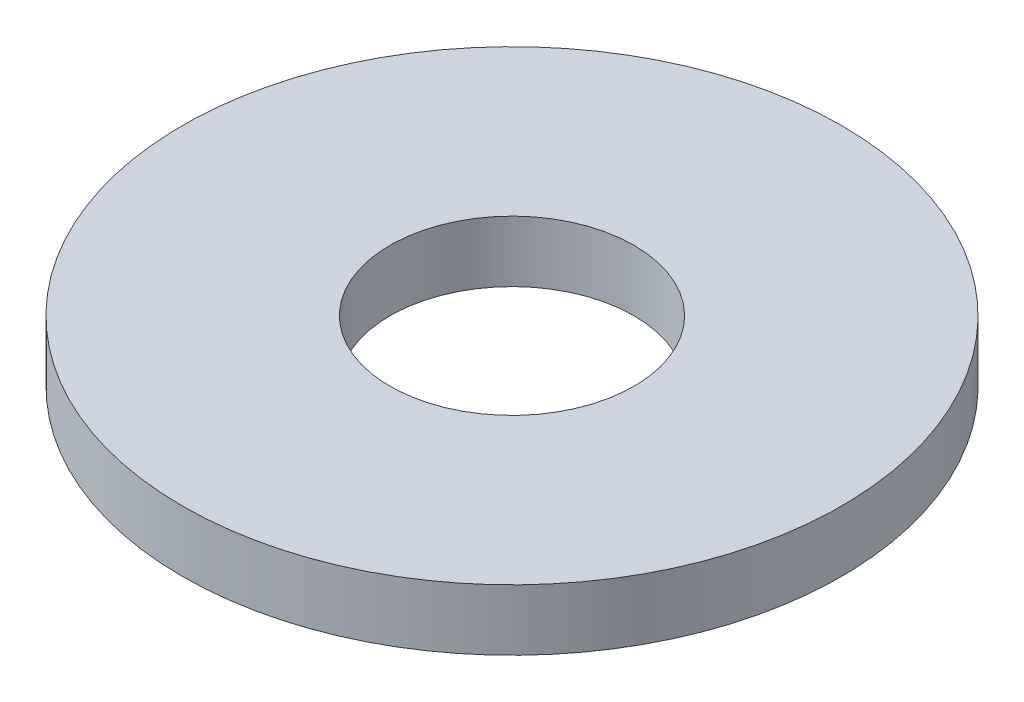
from build123d import *

# Parameters (mm, degrees)
ESQUISSE1_W = 5.1
ESQUISSE1_H = 1.5


with BuildPart() as part:
    # Esquisse1 → R_volution1 (revolve)
    with BuildSketch(Plane.XY, mode=Mode.PRIVATE) as r_volution1_sk:
        with Locations((5.55, 0.75)):
            Rectangle(ESQUISSE1_W, ESQUISSE1_H)
    revolve(r_volution1_sk.sketch.rotate(Axis((0, 1.5, 0), (0, -1, 0)), 270), axis=Axis((0, 1.5, 0), (0, -1, 0)))


solid = part.part
